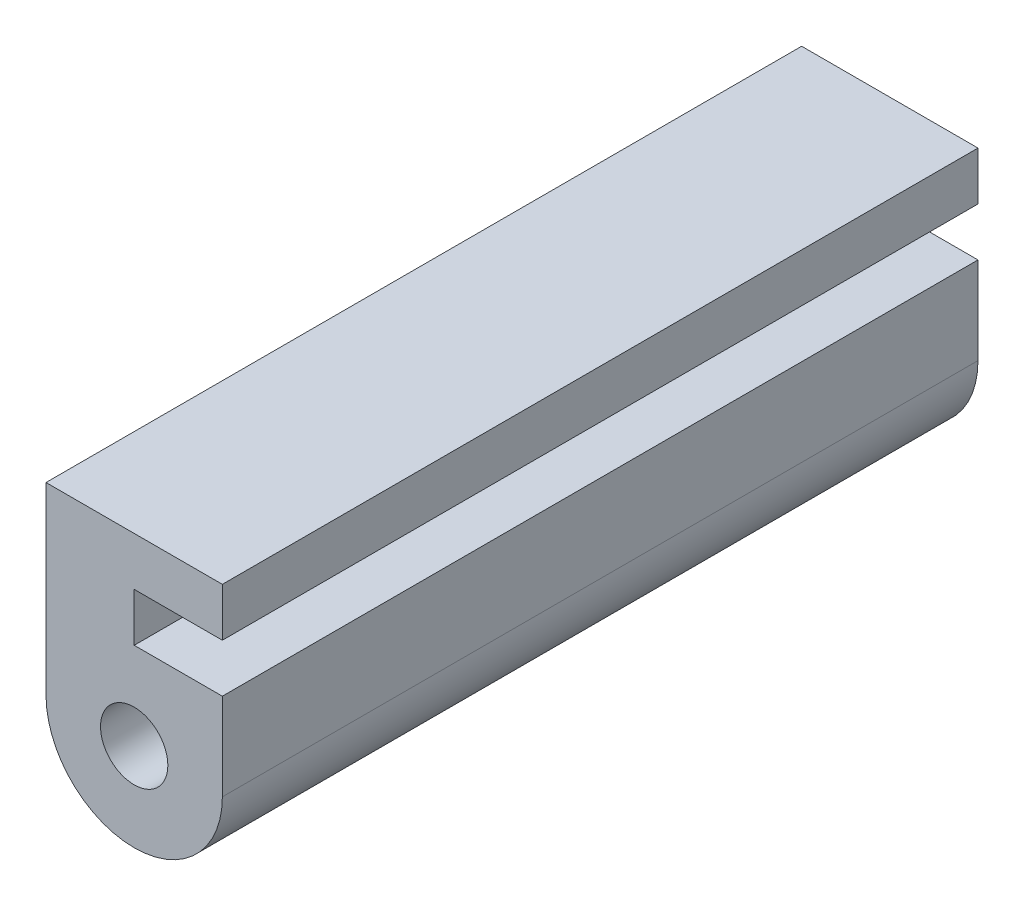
ISO-10303-21;
HEADER;
FILE_DESCRIPTION(('STEP AP214'),'2;1');
FILE_NAME('part.step','',(''),(''),'','','');
FILE_SCHEMA(('AUTOMOTIVE_DESIGN { 1 0 10303 214 1 1 1 1 }'));
ENDSEC;
DATA;
#1=APPLICATION_CONTEXT('core data for automotive mechanical design processes');
#2=APPLICATION_PROTOCOL_DEFINITION('international standard','automotive_design',2000,#1);
#3=PRODUCT_CONTEXT('',#1,'mechanical');
#4=PRODUCT('Part','Part','',(#3));
#5=PRODUCT_RELATED_PRODUCT_CATEGORY('part','',(#4));
#6=PRODUCT_DEFINITION_FORMATION('','',#4);
#7=PRODUCT_DEFINITION_CONTEXT('part definition',#1,'design');
#8=PRODUCT_DEFINITION('design','',#6,#7);
#9=PRODUCT_DEFINITION_SHAPE('','',#8);
#10=(LENGTH_UNIT() NAMED_UNIT(*) SI_UNIT(.MILLI.,.METRE.));
#11=(NAMED_UNIT(*) PLANE_ANGLE_UNIT() SI_UNIT($,.RADIAN.));
#12=(NAMED_UNIT(*) SI_UNIT($,.STERADIAN.) SOLID_ANGLE_UNIT());
#13=UNCERTAINTY_MEASURE_WITH_UNIT(LENGTH_MEASURE(1.E-05),#10,'distance_accuracy_value','');
#14=(GEOMETRIC_REPRESENTATION_CONTEXT(3) GLOBAL_UNCERTAINTY_ASSIGNED_CONTEXT((#13)) GLOBAL_UNIT_ASSIGNED_CONTEXT((#10,
#11,#12)) REPRESENTATION_CONTEXT('',''));
#15=CARTESIAN_POINT('',(0.,0.,0.));
#16=DIRECTION('',(0.,0.,1.));
#17=DIRECTION('',(1.,0.,0.));
#18=AXIS2_PLACEMENT_3D('',#15,#16,#17);
#19=CARTESIAN_POINT('',(0.,0.,78.));
#20=DIRECTION('',(0.,0.,1.));
#21=DIRECTION('',(1.,0.,0.));
#22=AXIS2_PLACEMENT_3D('',#19,#20,#21);
#23=PLANE('',#22);
#24=CARTESIAN_POINT('',(0.,0.,78.));
#25=DIRECTION('',(0.,0.,1.));
#26=DIRECTION('',(1.,0.,0.));
#27=AXIS2_PLACEMENT_3D('',#24,#25,#26);
#28=CIRCLE('',#27,9.10215158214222);
#29=CARTESIAN_POINT('',(-9.10215158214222,0.,78.));
#30=VERTEX_POINT('',#29);
#31=CARTESIAN_POINT('',(9.10215158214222,0.,78.));
#32=VERTEX_POINT('',#31);
#33=EDGE_CURVE('E146',#30,#32,#28,.T.);
#34=ORIENTED_EDGE('',*,*,#33,.T.);
#35=DIRECTION('',(0.,1.,0.));
#36=VECTOR('',#35,1.);
#37=CARTESIAN_POINT('',(9.10215158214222,0.,78.));
#38=LINE('',#37,#36);
#39=CARTESIAN_POINT('',(9.10215158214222,9.,78.));
#40=VERTEX_POINT('',#39);
#41=EDGE_CURVE('E94',#32,#40,#38,.T.);
#42=ORIENTED_EDGE('',*,*,#41,.T.);
#43=DIRECTION('',(-1.,0.,0.));
#44=VECTOR('',#43,1.);
#45=CARTESIAN_POINT('',(9.10215158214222,9.,78.));
#46=LINE('',#45,#44);
#47=CARTESIAN_POINT('',(0.00215158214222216,9.,78.));
#48=VERTEX_POINT('',#47);
#49=EDGE_CURVE('E161',#40,#48,#46,.T.);
#50=ORIENTED_EDGE('',*,*,#49,.T.);
#51=DIRECTION('',(0.,1.,0.));
#52=VECTOR('',#51,1.);
#53=CARTESIAN_POINT('',(0.00215158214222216,9.,78.));
#54=LINE('',#53,#52);
#55=CARTESIAN_POINT('',(0.00215158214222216,14.,78.));
#56=VERTEX_POINT('',#55);
#57=EDGE_CURVE('E174',#48,#56,#54,.T.);
#58=ORIENTED_EDGE('',*,*,#57,.T.);
#59=DIRECTION('',(1.,0.,0.));
#60=VECTOR('',#59,1.);
#61=CARTESIAN_POINT('',(9.10215158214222,14.,78.));
#62=LINE('',#61,#60);
#63=CARTESIAN_POINT('',(9.10215158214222,14.,78.));
#64=VERTEX_POINT('',#63);
#65=EDGE_CURVE('E113',#56,#64,#62,.T.);
#66=ORIENTED_EDGE('',*,*,#65,.T.);
#67=DIRECTION('',(0.,1.,0.));
#68=VECTOR('',#67,1.);
#69=CARTESIAN_POINT('',(9.10215158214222,14.,78.));
#70=LINE('',#69,#68);
#71=CARTESIAN_POINT('',(9.10215158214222,19.,78.));
#72=VERTEX_POINT('',#71);
#73=EDGE_CURVE('E107',#64,#72,#70,.T.);
#74=ORIENTED_EDGE('',*,*,#73,.T.);
#75=DIRECTION('',(-1.,0.,0.));
#76=VECTOR('',#75,1.);
#77=CARTESIAN_POINT('',(9.10215158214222,19.,78.));
#78=LINE('',#77,#76);
#79=CARTESIAN_POINT('',(-9.10215158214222,19.,78.));
#80=VERTEX_POINT('',#79);
#81=EDGE_CURVE('E111',#72,#80,#78,.T.);
#82=ORIENTED_EDGE('',*,*,#81,.T.);
#83=DIRECTION('',(0.,-1.,0.));
#84=VECTOR('',#83,1.);
#85=CARTESIAN_POINT('',(-9.10215158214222,0.,78.));
#86=LINE('',#85,#84);
#87=EDGE_CURVE('E51',#80,#30,#86,.T.);
#88=ORIENTED_EDGE('',*,*,#87,.T.);
#89=EDGE_LOOP('',(#34,#42,#50,#58,#66,#74,#82,#88));
#90=FACE_BOUND('',#89,.T.);
#91=CARTESIAN_POINT('',(0.,0.,78.));
#92=DIRECTION('',(0.,0.,1.));
#93=DIRECTION('',(1.,0.,0.));
#94=AXIS2_PLACEMENT_3D('',#91,#92,#93);
#95=CIRCLE('',#94,3.475);
#96=CARTESIAN_POINT('',(3.475,0.,78.));
#97=VERTEX_POINT('',#96);
#98=EDGE_CURVE('E135',#97,#97,#95,.T.);
#99=ORIENTED_EDGE('',*,*,#98,.F.);
#100=EDGE_LOOP('',(#99));
#101=FACE_BOUND('',#100,.T.);
#102=ADVANCED_FACE('F34',(#90,#101),#23,.T.);
#103=CARTESIAN_POINT('',(0.,0.,0.));
#104=DIRECTION('',(0.,0.,1.));
#105=DIRECTION('',(1.,0.,0.));
#106=AXIS2_PLACEMENT_3D('',#103,#104,#105);
#107=PLANE('',#106);
#108=CARTESIAN_POINT('',(0.,0.,0.));
#109=DIRECTION('',(0.,0.,1.));
#110=DIRECTION('',(1.,0.,0.));
#111=AXIS2_PLACEMENT_3D('',#108,#109,#110);
#112=CIRCLE('',#111,9.10215158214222);
#113=CARTESIAN_POINT('',(-9.10215158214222,0.,0.));
#114=VERTEX_POINT('',#113);
#115=CARTESIAN_POINT('',(9.10215158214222,0.,0.));
#116=VERTEX_POINT('',#115);
#117=EDGE_CURVE('E131',#114,#116,#112,.T.);
#118=ORIENTED_EDGE('',*,*,#117,.F.);
#119=DIRECTION('',(0.,-1.,0.));
#120=VECTOR('',#119,1.);
#121=CARTESIAN_POINT('',(-9.10215158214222,0.,0.));
#122=LINE('',#121,#120);
#123=CARTESIAN_POINT('',(-9.10215158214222,19.,0.));
#124=VERTEX_POINT('',#123);
#125=EDGE_CURVE('E86',#124,#114,#122,.T.);
#126=ORIENTED_EDGE('',*,*,#125,.F.);
#127=DIRECTION('',(-1.,0.,0.));
#128=VECTOR('',#127,1.);
#129=CARTESIAN_POINT('',(9.10215158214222,19.,0.));
#130=LINE('',#129,#128);
#131=CARTESIAN_POINT('',(9.10215158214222,19.,0.));
#132=VERTEX_POINT('',#131);
#133=EDGE_CURVE('E80',#132,#124,#130,.T.);
#134=ORIENTED_EDGE('',*,*,#133,.F.);
#135=DIRECTION('',(0.,1.,0.));
#136=VECTOR('',#135,1.);
#137=CARTESIAN_POINT('',(9.10215158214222,14.,0.));
#138=LINE('',#137,#136);
#139=CARTESIAN_POINT('',(9.10215158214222,14.,0.));
#140=VERTEX_POINT('',#139);
#141=EDGE_CURVE('E121',#140,#132,#138,.T.);
#142=ORIENTED_EDGE('',*,*,#141,.F.);
#143=DIRECTION('',(1.,0.,0.));
#144=VECTOR('',#143,1.);
#145=CARTESIAN_POINT('',(9.10215158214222,14.,0.));
#146=LINE('',#145,#144);
#147=CARTESIAN_POINT('',(0.00215158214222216,14.,0.));
#148=VERTEX_POINT('',#147);
#149=EDGE_CURVE('E141',#148,#140,#146,.T.);
#150=ORIENTED_EDGE('',*,*,#149,.F.);
#151=DIRECTION('',(0.,1.,0.));
#152=VECTOR('',#151,1.);
#153=CARTESIAN_POINT('',(0.00215158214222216,9.,0.));
#154=LINE('',#153,#152);
#155=CARTESIAN_POINT('',(0.00215158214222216,9.,0.));
#156=VERTEX_POINT('',#155);
#157=EDGE_CURVE('E139',#156,#148,#154,.T.);
#158=ORIENTED_EDGE('',*,*,#157,.F.);
#159=DIRECTION('',(-1.,0.,0.));
#160=VECTOR('',#159,1.);
#161=CARTESIAN_POINT('',(9.10215158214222,9.,0.));
#162=LINE('',#161,#160);
#163=CARTESIAN_POINT('',(9.10215158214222,9.,0.));
#164=VERTEX_POINT('',#163);
#165=EDGE_CURVE('E137',#164,#156,#162,.T.);
#166=ORIENTED_EDGE('',*,*,#165,.F.);
#167=DIRECTION('',(0.,1.,0.));
#168=VECTOR('',#167,1.);
#169=CARTESIAN_POINT('',(9.10215158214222,0.,0.));
#170=LINE('',#169,#168);
#171=EDGE_CURVE('E134',#116,#164,#170,.T.);
#172=ORIENTED_EDGE('',*,*,#171,.F.);
#173=EDGE_LOOP('',(#118,#126,#134,#142,#150,#158,#166,#172));
#174=FACE_BOUND('',#173,.T.);
#175=CARTESIAN_POINT('',(0.,0.,0.));
#176=DIRECTION('',(0.,0.,1.));
#177=DIRECTION('',(1.,0.,0.));
#178=AXIS2_PLACEMENT_3D('',#175,#176,#177);
#179=CIRCLE('',#178,3.475);
#180=CARTESIAN_POINT('',(3.475,0.,0.));
#181=VERTEX_POINT('',#180);
#182=EDGE_CURVE('E180',#181,#181,#179,.T.);
#183=ORIENTED_EDGE('',*,*,#182,.T.);
#184=EDGE_LOOP('',(#183));
#185=FACE_BOUND('',#184,.T.);
#186=ADVANCED_FACE('F165',(#174,#185),#107,.F.);
#187=CARTESIAN_POINT('',(0.,0.,78.));
#188=DIRECTION('',(0.,0.,-1.));
#189=DIRECTION('',(-1.,0.,0.));
#190=AXIS2_PLACEMENT_3D('',#187,#188,#189);
#191=CYLINDRICAL_SURFACE('',#190,9.10215158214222);
#192=ORIENTED_EDGE('',*,*,#117,.T.);
#193=DIRECTION('',(0.,0.,-1.));
#194=VECTOR('',#193,1.);
#195=CARTESIAN_POINT('',(9.10215158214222,0.,78.));
#196=LINE('',#195,#194);
#197=EDGE_CURVE('E11',#32,#116,#196,.T.);
#198=ORIENTED_EDGE('',*,*,#197,.F.);
#199=ORIENTED_EDGE('',*,*,#33,.F.);
#200=DIRECTION('',(0.,0.,-1.));
#201=VECTOR('',#200,1.);
#202=CARTESIAN_POINT('',(-9.10215158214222,0.,78.));
#203=LINE('',#202,#201);
#204=EDGE_CURVE('E127',#30,#114,#203,.T.);
#205=ORIENTED_EDGE('',*,*,#204,.T.);
#206=EDGE_LOOP('',(#192,#198,#199,#205));
#207=FACE_BOUND('',#206,.T.);
#208=ADVANCED_FACE('F36',(#207),#191,.T.);
#209=CARTESIAN_POINT('',(9.10215158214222,0.,78.));
#210=DIRECTION('',(-1.,0.,0.));
#211=DIRECTION('',(0.,-1.,0.));
#212=AXIS2_PLACEMENT_3D('',#209,#210,#211);
#213=PLANE('',#212);
#214=ORIENTED_EDGE('',*,*,#171,.T.);
#215=DIRECTION('',(0.,0.,-1.));
#216=VECTOR('',#215,1.);
#217=CARTESIAN_POINT('',(9.10215158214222,9.,78.));
#218=LINE('',#217,#216);
#219=EDGE_CURVE('E43',#40,#164,#218,.T.);
#220=ORIENTED_EDGE('',*,*,#219,.F.);
#221=ORIENTED_EDGE('',*,*,#41,.F.);
#222=ORIENTED_EDGE('',*,*,#197,.T.);
#223=EDGE_LOOP('',(#214,#220,#221,#222));
#224=FACE_BOUND('',#223,.T.);
#225=ADVANCED_FACE('F208',(#224),#213,.F.);
#226=CARTESIAN_POINT('',(9.10215158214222,9.,78.));
#227=DIRECTION('',(0.,-1.,0.));
#228=DIRECTION('',(1.,0.,0.));
#229=AXIS2_PLACEMENT_3D('',#226,#227,#228);
#230=PLANE('',#229);
#231=ORIENTED_EDGE('',*,*,#165,.T.);
#232=DIRECTION('',(0.,0.,-1.));
#233=VECTOR('',#232,1.);
#234=CARTESIAN_POINT('',(0.00215158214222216,9.,78.));
#235=LINE('',#234,#233);
#236=EDGE_CURVE('E153',#48,#156,#235,.T.);
#237=ORIENTED_EDGE('',*,*,#236,.F.);
#238=ORIENTED_EDGE('',*,*,#49,.F.);
#239=ORIENTED_EDGE('',*,*,#219,.T.);
#240=EDGE_LOOP('',(#231,#237,#238,#239));
#241=FACE_BOUND('',#240,.T.);
#242=ADVANCED_FACE('F159',(#241),#230,.F.);
#243=CARTESIAN_POINT('',(0.00215158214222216,9.,78.));
#244=DIRECTION('',(-1.,0.,0.));
#245=DIRECTION('',(0.,0.,1.));
#246=AXIS2_PLACEMENT_3D('',#243,#244,#245);
#247=PLANE('',#246);
#248=ORIENTED_EDGE('',*,*,#157,.T.);
#249=DIRECTION('',(0.,0.,-1.));
#250=VECTOR('',#249,1.);
#251=CARTESIAN_POINT('',(0.00215158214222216,14.,78.));
#252=LINE('',#251,#250);
#253=EDGE_CURVE('E150',#56,#148,#252,.T.);
#254=ORIENTED_EDGE('',*,*,#253,.F.);
#255=ORIENTED_EDGE('',*,*,#57,.F.);
#256=ORIENTED_EDGE('',*,*,#236,.T.);
#257=EDGE_LOOP('',(#248,#254,#255,#256));
#258=FACE_BOUND('',#257,.T.);
#259=ADVANCED_FACE('F170',(#258),#247,.F.);
#260=CARTESIAN_POINT('',(9.10215158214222,14.,78.));
#261=DIRECTION('',(0.,1.,0.));
#262=DIRECTION('',(0.,0.,1.));
#263=AXIS2_PLACEMENT_3D('',#260,#261,#262);
#264=PLANE('',#263);
#265=ORIENTED_EDGE('',*,*,#149,.T.);
#266=DIRECTION('',(0.,0.,-1.));
#267=VECTOR('',#266,1.);
#268=CARTESIAN_POINT('',(9.10215158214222,14.,78.));
#269=LINE('',#268,#267);
#270=EDGE_CURVE('E122',#64,#140,#269,.T.);
#271=ORIENTED_EDGE('',*,*,#270,.F.);
#272=ORIENTED_EDGE('',*,*,#65,.F.);
#273=ORIENTED_EDGE('',*,*,#253,.T.);
#274=EDGE_LOOP('',(#265,#271,#272,#273));
#275=FACE_BOUND('',#274,.T.);
#276=ADVANCED_FACE('F173',(#275),#264,.F.);
#277=CARTESIAN_POINT('',(9.10215158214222,14.,78.));
#278=DIRECTION('',(-1.,0.,0.));
#279=DIRECTION('',(0.,-1.,0.));
#280=AXIS2_PLACEMENT_3D('',#277,#278,#279);
#281=PLANE('',#280);
#282=ORIENTED_EDGE('',*,*,#141,.T.);
#283=DIRECTION('',(0.,0.,-1.));
#284=VECTOR('',#283,1.);
#285=CARTESIAN_POINT('',(9.10215158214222,19.,78.));
#286=LINE('',#285,#284);
#287=EDGE_CURVE('E118',#72,#132,#286,.T.);
#288=ORIENTED_EDGE('',*,*,#287,.F.);
#289=ORIENTED_EDGE('',*,*,#73,.F.);
#290=ORIENTED_EDGE('',*,*,#270,.T.);
#291=EDGE_LOOP('',(#282,#288,#289,#290));
#292=FACE_BOUND('',#291,.T.);
#293=ADVANCED_FACE('F119',(#292),#281,.F.);
#294=CARTESIAN_POINT('',(9.10215158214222,19.,78.));
#295=DIRECTION('',(0.,-1.,0.));
#296=DIRECTION('',(0.,0.,-1.));
#297=AXIS2_PLACEMENT_3D('',#294,#295,#296);
#298=PLANE('',#297);
#299=ORIENTED_EDGE('',*,*,#133,.T.);
#300=DIRECTION('',(0.,0.,-1.));
#301=VECTOR('',#300,1.);
#302=CARTESIAN_POINT('',(-9.10215158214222,19.,78.));
#303=LINE('',#302,#301);
#304=EDGE_CURVE('E123',#80,#124,#303,.T.);
#305=ORIENTED_EDGE('',*,*,#304,.F.);
#306=ORIENTED_EDGE('',*,*,#81,.F.);
#307=ORIENTED_EDGE('',*,*,#287,.T.);
#308=EDGE_LOOP('',(#299,#305,#306,#307));
#309=FACE_BOUND('',#308,.T.);
#310=ADVANCED_FACE('F125',(#309),#298,.F.);
#311=CARTESIAN_POINT('',(-9.10215158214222,0.,78.));
#312=DIRECTION('',(1.,0.,0.));
#313=DIRECTION('',(0.,0.,-1.));
#314=AXIS2_PLACEMENT_3D('',#311,#312,#313);
#315=PLANE('',#314);
#316=ORIENTED_EDGE('',*,*,#125,.T.);
#317=ORIENTED_EDGE('',*,*,#204,.F.);
#318=ORIENTED_EDGE('',*,*,#87,.F.);
#319=ORIENTED_EDGE('',*,*,#304,.T.);
#320=EDGE_LOOP('',(#316,#317,#318,#319));
#321=FACE_BOUND('',#320,.T.);
#322=ADVANCED_FACE('F196',(#321),#315,.F.);
#323=CARTESIAN_POINT('',(0.,0.,78.));
#324=DIRECTION('',(0.,0.,-1.));
#325=DIRECTION('',(-1.,0.,0.));
#326=AXIS2_PLACEMENT_3D('',#323,#324,#325);
#327=CYLINDRICAL_SURFACE('',#326,3.475);
#328=ORIENTED_EDGE('',*,*,#98,.T.);
#329=EDGE_LOOP('',(#328));
#330=FACE_BOUND('',#329,.T.);
#331=ORIENTED_EDGE('',*,*,#182,.F.);
#332=EDGE_LOOP('',(#331));
#333=FACE_BOUND('',#332,.T.);
#334=ADVANCED_FACE('F186',(#330,#333),#327,.F.);
#335=CLOSED_SHELL('',(#102,#186,#208,#225,#242,#259,#276,#293,#310,#322,#334));
#336=MANIFOLD_SOLID_BREP('B2',#335);
#337=ADVANCED_BREP_SHAPE_REPRESENTATION('',(#18,#336),#14);
#338=SHAPE_DEFINITION_REPRESENTATION(#9,#337);
ENDSEC;
END-ISO-10303-21;
